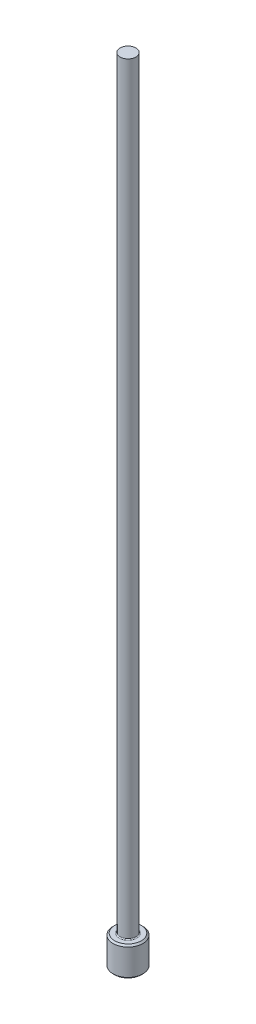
ISO-10303-21;
HEADER;
FILE_DESCRIPTION(('STEP AP214'),'2;1');
FILE_NAME('part.step','',(''),(''),'','','');
FILE_SCHEMA(('AUTOMOTIVE_DESIGN { 1 0 10303 214 1 1 1 1 }'));
ENDSEC;
DATA;
#1=APPLICATION_CONTEXT('core data for automotive mechanical design processes');
#2=APPLICATION_PROTOCOL_DEFINITION('international standard','automotive_design',2000,#1);
#3=PRODUCT_CONTEXT('',#1,'mechanical');
#4=PRODUCT('Part','Part','',(#3));
#5=PRODUCT_RELATED_PRODUCT_CATEGORY('part','',(#4));
#6=PRODUCT_DEFINITION_FORMATION('','',#4);
#7=PRODUCT_DEFINITION_CONTEXT('part definition',#1,'design');
#8=PRODUCT_DEFINITION('design','',#6,#7);
#9=PRODUCT_DEFINITION_SHAPE('','',#8);
#10=(LENGTH_UNIT() NAMED_UNIT(*) SI_UNIT(.MILLI.,.METRE.));
#11=(NAMED_UNIT(*) PLANE_ANGLE_UNIT() SI_UNIT($,.RADIAN.));
#12=(NAMED_UNIT(*) SI_UNIT($,.STERADIAN.) SOLID_ANGLE_UNIT());
#13=UNCERTAINTY_MEASURE_WITH_UNIT(LENGTH_MEASURE(1.E-05),#10,'distance_accuracy_value','');
#14=(GEOMETRIC_REPRESENTATION_CONTEXT(3) GLOBAL_UNCERTAINTY_ASSIGNED_CONTEXT((#13)) GLOBAL_UNIT_ASSIGNED_CONTEXT((#10,
#11,#12)) REPRESENTATION_CONTEXT('',''));
#15=CARTESIAN_POINT('',(0.,0.,0.));
#16=DIRECTION('',(0.,0.,1.));
#17=DIRECTION('',(1.,0.,0.));
#18=AXIS2_PLACEMENT_3D('',#15,#16,#17);
#19=CARTESIAN_POINT('',(0.,0.,0.));
#20=DIRECTION('',(0.,-1.,0.));
#21=DIRECTION('',(0.,0.,-1.));
#22=AXIS2_PLACEMENT_3D('',#19,#20,#21);
#23=PLANE('',#22);
#24=CARTESIAN_POINT('',(0.,0.,0.));
#25=DIRECTION('',(0.,-1.,0.));
#26=DIRECTION('',(0.,0.,-1.));
#27=AXIS2_PLACEMENT_3D('',#24,#25,#26);
#28=CIRCLE('',#27,1.06679999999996);
#29=CARTESIAN_POINT('',(0.,0.,-1.06679999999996));
#30=VERTEX_POINT('',#29);
#31=EDGE_CURVE('E46',#30,#30,#28,.T.);
#32=ORIENTED_EDGE('',*,*,#31,.T.);
#33=EDGE_LOOP('',(#32));
#34=FACE_BOUND('',#33,.T.);
#35=ADVANCED_FACE('F35',(#34),#23,.T.);
#36=CARTESIAN_POINT('',(0.,259.958771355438,0.));
#37=DIRECTION('',(0.,1.,0.));
#38=DIRECTION('',(0.,0.,1.));
#39=AXIS2_PLACEMENT_3D('',#36,#37,#38);
#40=CYLINDRICAL_SURFACE('',#39,1.19379999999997);
#41=CARTESIAN_POINT('',(0.,2.23519999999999,0.));
#42=DIRECTION('',(0.,1.,0.));
#43=DIRECTION('',(0.,0.,1.));
#44=AXIS2_PLACEMENT_3D('',#41,#42,#43);
#45=CIRCLE('',#44,1.19379999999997);
#46=CARTESIAN_POINT('',(0.,2.23519999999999,1.19379999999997));
#47=VERTEX_POINT('',#46);
#48=EDGE_CURVE('E50',#47,#47,#45,.F.);
#49=ORIENTED_EDGE('',*,*,#48,.T.);
#50=EDGE_LOOP('',(#49));
#51=FACE_BOUND('',#50,.T.);
#52=CARTESIAN_POINT('',(0.,0.126999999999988,0.));
#53=DIRECTION('',(0.,-1.,0.));
#54=DIRECTION('',(0.,0.,-1.));
#55=AXIS2_PLACEMENT_3D('',#52,#53,#54);
#56=CIRCLE('',#55,1.19379999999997);
#57=CARTESIAN_POINT('',(0.,0.126999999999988,-1.19379999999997));
#58=VERTEX_POINT('',#57);
#59=EDGE_CURVE('E55',#58,#58,#56,.F.);
#60=ORIENTED_EDGE('',*,*,#59,.T.);
#61=EDGE_LOOP('',(#60));
#62=FACE_BOUND('',#61,.T.);
#63=ADVANCED_FACE('F77',(#51,#62),#40,.T.);
#64=CARTESIAN_POINT('',(-1.19379999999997,2.3622,0.));
#65=DIRECTION('',(0.,1.,0.));
#66=DIRECTION('',(0.,0.,1.));
#67=AXIS2_PLACEMENT_3D('',#64,#65,#66);
#68=PLANE('',#67);
#69=CARTESIAN_POINT('',(0.,2.3622,0.));
#70=DIRECTION('',(0.,1.,0.));
#71=DIRECTION('',(0.,0.,1.));
#72=AXIS2_PLACEMENT_3D('',#69,#70,#71);
#73=CIRCLE('',#72,0.711199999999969);
#74=CARTESIAN_POINT('',(0.,2.3622,0.711199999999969));
#75=VERTEX_POINT('',#74);
#76=EDGE_CURVE('E10',#75,#75,#73,.F.);
#77=ORIENTED_EDGE('',*,*,#76,.T.);
#78=EDGE_LOOP('',(#77));
#79=FACE_BOUND('',#78,.T.);
#80=CARTESIAN_POINT('',(0.,2.3622,0.));
#81=DIRECTION('',(0.,1.,0.));
#82=DIRECTION('',(0.,0.,1.));
#83=AXIS2_PLACEMENT_3D('',#80,#81,#82);
#84=CIRCLE('',#83,1.06679999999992);
#85=CARTESIAN_POINT('',(0.,2.3622,1.06679999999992));
#86=VERTEX_POINT('',#85);
#87=EDGE_CURVE('E58',#86,#86,#84,.T.);
#88=ORIENTED_EDGE('',*,*,#87,.T.);
#89=EDGE_LOOP('',(#88));
#90=FACE_BOUND('',#89,.T.);
#91=ADVANCED_FACE('F69',(#79,#90),#68,.T.);
#92=CARTESIAN_POINT('',(0.,259.958771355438,0.));
#93=DIRECTION('',(0.,1.,0.));
#94=DIRECTION('',(0.,0.,1.));
#95=AXIS2_PLACEMENT_3D('',#92,#93,#94);
#96=CYLINDRICAL_SURFACE('',#95,0.634999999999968);
#97=CARTESIAN_POINT('',(0.,2.43840000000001,0.));
#98=DIRECTION('',(0.,1.,0.));
#99=DIRECTION('',(0.,0.,1.));
#100=AXIS2_PLACEMENT_3D('',#97,#98,#99);
#101=CIRCLE('',#100,0.634999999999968);
#102=CARTESIAN_POINT('',(0.,2.43840000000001,0.634999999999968));
#103=VERTEX_POINT('',#102);
#104=EDGE_CURVE('E42',#103,#103,#101,.T.);
#105=ORIENTED_EDGE('',*,*,#104,.T.);
#106=EDGE_LOOP('',(#105));
#107=FACE_BOUND('',#106,.T.);
#108=CARTESIAN_POINT('',(0.,63.5,0.));
#109=DIRECTION('',(0.,1.,0.));
#110=DIRECTION('',(0.,0.,1.));
#111=AXIS2_PLACEMENT_3D('',#108,#109,#110);
#112=CIRCLE('',#111,0.634999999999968);
#113=CARTESIAN_POINT('',(0.,63.5,0.634999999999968));
#114=VERTEX_POINT('',#113);
#115=EDGE_CURVE('E61',#114,#114,#112,.T.);
#116=ORIENTED_EDGE('',*,*,#115,.F.);
#117=EDGE_LOOP('',(#116));
#118=FACE_BOUND('',#117,.T.);
#119=ADVANCED_FACE('F67',(#107,#118),#96,.T.);
#120=CARTESIAN_POINT('',(-0.634999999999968,63.5,0.));
#121=DIRECTION('',(0.,1.,0.));
#122=DIRECTION('',(0.,0.,1.));
#123=AXIS2_PLACEMENT_3D('',#120,#121,#122);
#124=PLANE('',#123);
#125=ORIENTED_EDGE('',*,*,#115,.T.);
#126=EDGE_LOOP('',(#125));
#127=FACE_BOUND('',#126,.T.);
#128=ADVANCED_FACE('F65',(#127),#124,.T.);
#129=CARTESIAN_POINT('',(0.,2.36219999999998,0.));
#130=DIRECTION('',(0.,-1.,0.));
#131=DIRECTION('',(0.,0.,-1.));
#132=AXIS2_PLACEMENT_3D('',#129,#130,#131);
#133=CONICAL_SURFACE('',#132,1.06679999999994,0.785398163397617);
#134=ORIENTED_EDGE('',*,*,#48,.F.);
#135=EDGE_LOOP('',(#134));
#136=FACE_BOUND('',#135,.T.);
#137=ORIENTED_EDGE('',*,*,#87,.F.);
#138=EDGE_LOOP('',(#137));
#139=FACE_BOUND('',#138,.T.);
#140=ADVANCED_FACE('F75',(#136,#139),#133,.T.);
#141=CARTESIAN_POINT('',(0.,0.126999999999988,0.));
#142=DIRECTION('',(0.,1.,0.));
#143=DIRECTION('',(0.,0.,1.));
#144=AXIS2_PLACEMENT_3D('',#141,#142,#143);
#145=CONICAL_SURFACE('',#144,1.19379999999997,0.785398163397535);
#146=ORIENTED_EDGE('',*,*,#31,.F.);
#147=EDGE_LOOP('',(#146));
#148=FACE_BOUND('',#147,.T.);
#149=ORIENTED_EDGE('',*,*,#59,.F.);
#150=EDGE_LOOP('',(#149));
#151=FACE_BOUND('',#150,.T.);
#152=ADVANCED_FACE('F89',(#148,#151),#145,.T.);
#153=CARTESIAN_POINT('',(0.,2.43840000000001,0.));
#154=DIRECTION('',(0.,1.,0.));
#155=DIRECTION('',(0.,0.,1.));
#156=AXIS2_PLACEMENT_3D('',#153,#154,#155);
#157=TOROIDAL_SURFACE('',#156,0.711199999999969,0.0762);
#158=ORIENTED_EDGE('',*,*,#76,.F.);
#159=EDGE_LOOP('',(#158));
#160=FACE_BOUND('',#159,.T.);
#161=ORIENTED_EDGE('',*,*,#104,.F.);
#162=EDGE_LOOP('',(#161));
#163=FACE_BOUND('',#162,.T.);
#164=ADVANCED_FACE('F37',(#160,#163),#157,.F.);
#165=CLOSED_SHELL('',(#35,#63,#91,#119,#128,#140,#152,#164));
#166=MANIFOLD_SOLID_BREP('B2',#165);
#167=ADVANCED_BREP_SHAPE_REPRESENTATION('',(#18,#166),#14);
#168=SHAPE_DEFINITION_REPRESENTATION(#9,#167);
ENDSEC;
END-ISO-10303-21;
